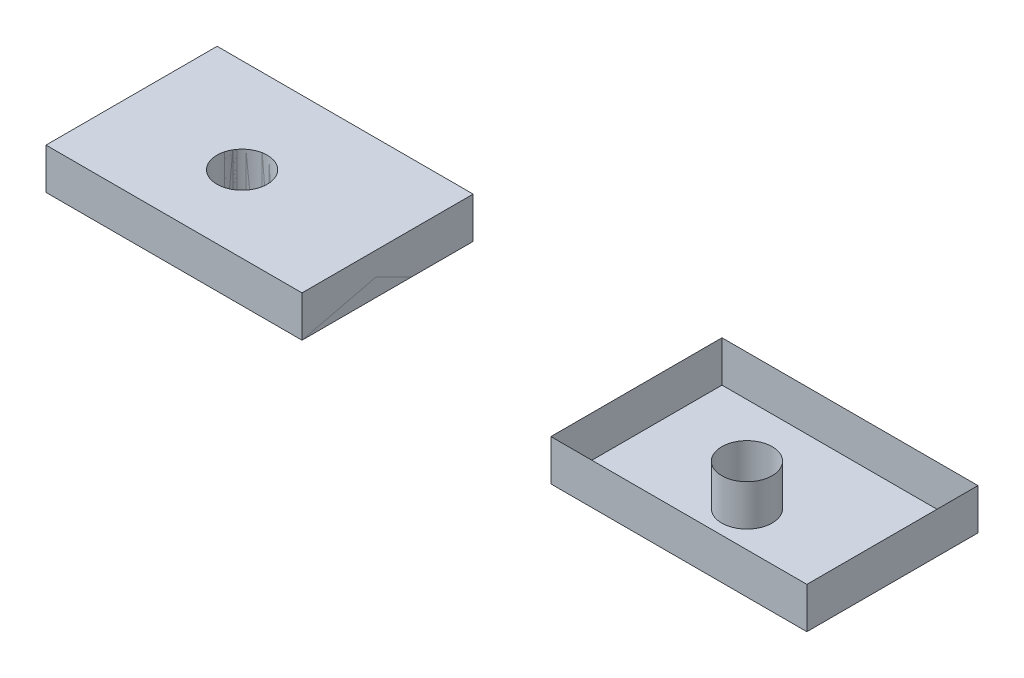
ISO-10303-21;
HEADER;
FILE_DESCRIPTION(('STEP AP214'),'2;1');
FILE_NAME('part.step','',(''),(''),'','','');
FILE_SCHEMA(('AUTOMOTIVE_DESIGN { 1 0 10303 214 1 1 1 1 }'));
ENDSEC;
DATA;
#1=APPLICATION_CONTEXT('core data for automotive mechanical design processes');
#2=APPLICATION_PROTOCOL_DEFINITION('international standard','automotive_design',2000,#1);
#3=PRODUCT_CONTEXT('',#1,'mechanical');
#4=PRODUCT('Part','Part','',(#3));
#5=PRODUCT_RELATED_PRODUCT_CATEGORY('part','',(#4));
#6=PRODUCT_DEFINITION_FORMATION('','',#4);
#7=PRODUCT_DEFINITION_CONTEXT('part definition',#1,'design');
#8=PRODUCT_DEFINITION('design','',#6,#7);
#9=PRODUCT_DEFINITION_SHAPE('','',#8);
#10=(LENGTH_UNIT() NAMED_UNIT(*) SI_UNIT(.MILLI.,.METRE.));
#11=(NAMED_UNIT(*) PLANE_ANGLE_UNIT() SI_UNIT($,.RADIAN.));
#12=(NAMED_UNIT(*) SI_UNIT($,.STERADIAN.) SOLID_ANGLE_UNIT());
#13=UNCERTAINTY_MEASURE_WITH_UNIT(LENGTH_MEASURE(1.E-05),#10,'distance_accuracy_value','');
#14=(GEOMETRIC_REPRESENTATION_CONTEXT(3) GLOBAL_UNCERTAINTY_ASSIGNED_CONTEXT((#13)) GLOBAL_UNIT_ASSIGNED_CONTEXT((#10,
#11,#12)) REPRESENTATION_CONTEXT('',''));
#15=CARTESIAN_POINT('',(0.,0.,0.));
#16=DIRECTION('',(0.,0.,1.));
#17=DIRECTION('',(1.,0.,0.));
#18=AXIS2_PLACEMENT_3D('',#15,#16,#17);
#19=CARTESIAN_POINT('',(490.265330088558,0.,-38.835495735));
#20=DIRECTION('',(0.,1.,0.));
#21=DIRECTION('',(0.,0.,1.));
#22=AXIS2_PLACEMENT_3D('',#19,#20,#21);
#23=CYLINDRICAL_SURFACE('',#22,12.7580583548);
#24=CARTESIAN_POINT('',(490.265330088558,20.7672057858,-38.835495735));
#25=DIRECTION('',(0.,1.,0.));
#26=DIRECTION('',(0.,0.,1.));
#27=AXIS2_PLACEMENT_3D('',#24,#25,#26);
#28=CIRCLE('',#27,12.7580583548);
#29=CARTESIAN_POINT('',(490.265330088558,20.7672057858,-26.0774373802));
#30=VERTEX_POINT('',#29);
#31=EDGE_CURVE('P0_E12',#30,#30,#28,.T.);
#32=ORIENTED_EDGE('',*,*,#31,.F.);
#33=EDGE_LOOP('',(#32));
#34=FACE_BOUND('',#33,.T.);
#35=CARTESIAN_POINT('',(490.265330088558,0.,-38.835495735));
#36=DIRECTION('',(0.,1.,0.));
#37=DIRECTION('',(0.,0.,1.));
#38=AXIS2_PLACEMENT_3D('',#35,#36,#37);
#39=CIRCLE('',#38,12.7580583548);
#40=CARTESIAN_POINT('',(490.265330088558,0.,-26.0774373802));
#41=VERTEX_POINT('',#40);
#42=EDGE_CURVE('P0_E43',#41,#41,#39,.F.);
#43=ORIENTED_EDGE('',*,*,#42,.F.);
#44=EDGE_LOOP('',(#43));
#45=FACE_BOUND('',#44,.T.);
#46=ADVANCED_FACE('P0_F40',(#34,#45),#23,.T.);
#47=CARTESIAN_POINT('',(429.841584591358,0.,0.));
#48=DIRECTION('',(0.,-1.,0.));
#49=DIRECTION('',(0.,0.,-1.));
#50=AXIS2_PLACEMENT_3D('',#47,#48,#49);
#51=PLANE('',#50);
#52=ORIENTED_EDGE('',*,*,#42,.T.);
#53=EDGE_LOOP('',(#52));
#54=FACE_BOUND('',#53,.T.);
#55=DIRECTION('',(0.,0.,1.));
#56=VECTOR('',#55,1.);
#57=CARTESIAN_POINT('',(559.431427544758,0.,-43.3127745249));
#58=LINE('',#57,#56);
#59=CARTESIAN_POINT('',(559.431427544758,0.,-86.6255490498));
#60=VERTEX_POINT('',#59);
#61=CARTESIAN_POINT('',(559.431427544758,0.,0.));
#62=VERTEX_POINT('',#61);
#63=EDGE_CURVE('P0_E56',#60,#62,#58,.T.);
#64=ORIENTED_EDGE('',*,*,#63,.F.);
#65=DIRECTION('',(1.,0.,0.));
#66=VECTOR('',#65,1.);
#67=CARTESIAN_POINT('',(494.636506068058,0.,-86.6255490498));
#68=LINE('',#67,#66);
#69=CARTESIAN_POINT('',(429.841584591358,0.,-86.6255490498));
#70=VERTEX_POINT('',#69);
#71=EDGE_CURVE('P0_E115',#70,#60,#68,.T.);
#72=ORIENTED_EDGE('',*,*,#71,.F.);
#73=DIRECTION('',(0.,0.,-1.));
#74=VECTOR('',#73,1.);
#75=CARTESIAN_POINT('',(429.841584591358,0.,-43.3127745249));
#76=LINE('',#75,#74);
#77=CARTESIAN_POINT('',(429.841584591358,0.,0.));
#78=VERTEX_POINT('',#77);
#79=EDGE_CURVE('P0_E86',#78,#70,#76,.T.);
#80=ORIENTED_EDGE('',*,*,#79,.F.);
#81=DIRECTION('',(-1.,0.,0.));
#82=VECTOR('',#81,1.);
#83=CARTESIAN_POINT('',(494.636506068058,0.,0.));
#84=LINE('',#83,#82);
#85=EDGE_CURVE('P0_E112',#62,#78,#84,.T.);
#86=ORIENTED_EDGE('',*,*,#85,.F.);
#87=EDGE_LOOP('',(#64,#72,#80,#86));
#88=FACE_BOUND('',#87,.T.);
#89=ADVANCED_FACE('P0_F120',(#54,#88),#51,.F.);
#90=CARTESIAN_POINT('',(559.431427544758,0.,0.));
#91=DIRECTION('',(0.,0.,-1.));
#92=DIRECTION('',(-1.,0.,0.));
#93=AXIS2_PLACEMENT_3D('',#90,#91,#92);
#94=PLANE('',#93);
#95=DIRECTION('',(0.,-1.,0.));
#96=VECTOR('',#95,1.);
#97=CARTESIAN_POINT('',(559.431427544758,10.3836028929,0.));
#98=LINE('',#97,#96);
#99=CARTESIAN_POINT('',(559.431427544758,20.7672057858,0.));
#100=VERTEX_POINT('',#99);
#101=EDGE_CURVE('P0_E73',#100,#62,#98,.T.);
#102=ORIENTED_EDGE('',*,*,#101,.T.);
#103=ORIENTED_EDGE('',*,*,#85,.T.);
#104=DIRECTION('',(0.,1.,0.));
#105=VECTOR('',#104,1.);
#106=CARTESIAN_POINT('',(429.841584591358,10.3836028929,0.));
#107=LINE('',#106,#105);
#108=CARTESIAN_POINT('',(429.841584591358,20.7672057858,0.));
#109=VERTEX_POINT('',#108);
#110=EDGE_CURVE('P0_E70',#78,#109,#107,.T.);
#111=ORIENTED_EDGE('',*,*,#110,.T.);
#112=DIRECTION('',(1.,0.,0.));
#113=VECTOR('',#112,1.);
#114=CARTESIAN_POINT('',(494.636506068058,20.7672057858,0.));
#115=LINE('',#114,#113);
#116=EDGE_CURVE('P0_E107',#109,#100,#115,.T.);
#117=ORIENTED_EDGE('',*,*,#116,.T.);
#118=EDGE_LOOP('',(#102,#103,#111,#117));
#119=FACE_BOUND('',#118,.T.);
#120=ADVANCED_FACE('P0_F122',(#119),#94,.T.);
#121=CARTESIAN_POINT('',(559.431427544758,0.,-86.6255490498));
#122=DIRECTION('',(-1.,0.,0.));
#123=DIRECTION('',(0.,0.,1.));
#124=AXIS2_PLACEMENT_3D('',#121,#122,#123);
#125=PLANE('',#124);
#126=DIRECTION('',(0.,-1.,0.));
#127=VECTOR('',#126,1.);
#128=CARTESIAN_POINT('',(559.431427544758,10.3836028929,-86.6255490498));
#129=LINE('',#128,#127);
#130=CARTESIAN_POINT('',(559.431427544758,20.7672057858,-86.6255490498));
#131=VERTEX_POINT('',#130);
#132=EDGE_CURVE('P0_E97',#131,#60,#129,.T.);
#133=ORIENTED_EDGE('',*,*,#132,.T.);
#134=ORIENTED_EDGE('',*,*,#63,.T.);
#135=ORIENTED_EDGE('',*,*,#101,.F.);
#136=DIRECTION('',(0.,0.,-1.));
#137=VECTOR('',#136,1.);
#138=CARTESIAN_POINT('',(559.431427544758,20.7672057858,-43.3127745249));
#139=LINE('',#138,#137);
#140=EDGE_CURVE('P0_E90',#100,#131,#139,.T.);
#141=ORIENTED_EDGE('',*,*,#140,.T.);
#142=EDGE_LOOP('',(#133,#134,#135,#141));
#143=FACE_BOUND('',#142,.T.);
#144=ADVANCED_FACE('P0_F118',(#143),#125,.T.);
#145=CARTESIAN_POINT('',(429.841584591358,0.,-86.6255490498));
#146=DIRECTION('',(0.,0.,1.));
#147=DIRECTION('',(1.,0.,0.));
#148=AXIS2_PLACEMENT_3D('',#145,#146,#147);
#149=PLANE('',#148);
#150=DIRECTION('',(0.,-1.,0.));
#151=VECTOR('',#150,1.);
#152=CARTESIAN_POINT('',(429.841584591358,10.3836028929,-86.6255490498));
#153=LINE('',#152,#151);
#154=CARTESIAN_POINT('',(429.841584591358,20.7672057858,-86.6255490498));
#155=VERTEX_POINT('',#154);
#156=EDGE_CURVE('P0_E82',#155,#70,#153,.T.);
#157=ORIENTED_EDGE('',*,*,#156,.T.);
#158=ORIENTED_EDGE('',*,*,#71,.T.);
#159=ORIENTED_EDGE('',*,*,#132,.F.);
#160=DIRECTION('',(-1.,0.,0.));
#161=VECTOR('',#160,1.);
#162=CARTESIAN_POINT('',(494.636506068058,20.7672057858,-86.6255490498));
#163=LINE('',#162,#161);
#164=EDGE_CURVE('P0_E91',#131,#155,#163,.T.);
#165=ORIENTED_EDGE('',*,*,#164,.T.);
#166=EDGE_LOOP('',(#157,#158,#159,#165));
#167=FACE_BOUND('',#166,.T.);
#168=ADVANCED_FACE('P0_F96',(#167),#149,.T.);
#169=CARTESIAN_POINT('',(429.841584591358,0.,0.));
#170=DIRECTION('',(1.,0.,0.));
#171=DIRECTION('',(0.,0.,-1.));
#172=AXIS2_PLACEMENT_3D('',#169,#170,#171);
#173=PLANE('',#172);
#174=ORIENTED_EDGE('',*,*,#110,.F.);
#175=ORIENTED_EDGE('',*,*,#79,.T.);
#176=ORIENTED_EDGE('',*,*,#156,.F.);
#177=DIRECTION('',(0.,0.,1.));
#178=VECTOR('',#177,1.);
#179=CARTESIAN_POINT('',(429.841584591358,20.7672057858,-43.3127745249));
#180=LINE('',#179,#178);
#181=EDGE_CURVE('P0_E84',#155,#109,#180,.T.);
#182=ORIENTED_EDGE('',*,*,#181,.T.);
#183=EDGE_LOOP('',(#174,#175,#176,#182));
#184=FACE_BOUND('',#183,.T.);
#185=ADVANCED_FACE('P0_F41',(#184),#173,.T.);
#186=OPEN_SHELL('',(#46,#89,#120,#144,#168,#185));
#187=SHELL_BASED_SURFACE_MODEL('P0_B2',(#186));
#188=CARTESIAN_POINT('',(174.275363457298,20.7672057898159,0.));
#189=DIRECTION('',(1.,0.,0.));
#190=DIRECTION('',(0.,0.,-1.));
#191=AXIS2_PLACEMENT_3D('',#188,#189,#190);
#192=PLANE('',#191);
#193=DIRECTION('',(0.,0.,1.));
#194=VECTOR('',#193,1.);
#195=CARTESIAN_POINT('',(174.275363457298,0.,0.));
#196=LINE('',#195,#194);
#197=CARTESIAN_POINT('',(174.275363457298,0.,-86.6255490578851));
#198=VERTEX_POINT('',#197);
#199=CARTESIAN_POINT('',(174.275363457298,0.,0.));
#200=VERTEX_POINT('',#199);
#201=EDGE_CURVE('P0_E230',#198,#200,#196,.T.);
#202=ORIENTED_EDGE('',*,*,#201,.T.);
#203=DIRECTION('',(0.,-1.,0.));
#204=VECTOR('',#203,1.);
#205=CARTESIAN_POINT('',(174.275363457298,20.7672057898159,0.));
#206=LINE('',#205,#204);
#207=CARTESIAN_POINT('',(174.275363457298,20.7672057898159,0.));
#208=VERTEX_POINT('',#207);
#209=EDGE_CURVE('P0_E38',#208,#200,#206,.T.);
#210=ORIENTED_EDGE('',*,*,#209,.F.);
#211=DIRECTION('',(0.,0.,1.));
#212=VECTOR('',#211,1.);
#213=CARTESIAN_POINT('',(174.275363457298,20.7672057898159,0.));
#214=LINE('',#213,#212);
#215=CARTESIAN_POINT('',(174.275363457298,20.7672057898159,-86.6255490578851));
#216=VERTEX_POINT('',#215);
#217=EDGE_CURVE('P0_E253',#216,#208,#214,.T.);
#218=ORIENTED_EDGE('',*,*,#217,.F.);
#219=DIRECTION('',(0.,-1.,0.));
#220=VECTOR('',#219,1.);
#221=CARTESIAN_POINT('',(174.275363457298,20.7672057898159,-86.6255490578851));
#222=LINE('',#221,#220);
#223=EDGE_CURVE('P0_E242',#216,#198,#222,.T.);
#224=ORIENTED_EDGE('',*,*,#223,.T.);
#225=EDGE_LOOP('',(#202,#210,#218,#224));
#226=FACE_BOUND('',#225,.T.);
#227=ADVANCED_FACE('P0_F186',(#226),#192,.F.);
#228=CARTESIAN_POINT('',(174.275363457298,20.7672057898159,0.));
#229=DIRECTION('',(0.,0.,-1.));
#230=DIRECTION('',(-1.,0.,0.));
#231=AXIS2_PLACEMENT_3D('',#228,#229,#230);
#232=PLANE('',#231);
#233=DIRECTION('',(1.,0.,0.));
#234=VECTOR('',#233,1.);
#235=CARTESIAN_POINT('',(174.275363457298,0.,0.));
#236=LINE('',#235,#234);
#237=CARTESIAN_POINT('',(303.86520640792,0.,0.));
#238=VERTEX_POINT('',#237);
#239=EDGE_CURVE('P0_E226',#200,#238,#236,.T.);
#240=ORIENTED_EDGE('',*,*,#239,.T.);
#241=DIRECTION('',(0.,-1.,0.));
#242=VECTOR('',#241,1.);
#243=CARTESIAN_POINT('',(303.86520640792,20.7672057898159,0.));
#244=LINE('',#243,#242);
#245=CARTESIAN_POINT('',(303.86520640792,20.7672057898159,0.));
#246=VERTEX_POINT('',#245);
#247=EDGE_CURVE('P0_E193',#246,#238,#244,.T.);
#248=ORIENTED_EDGE('',*,*,#247,.F.);
#249=DIRECTION('',(1.,0.,0.));
#250=VECTOR('',#249,1.);
#251=CARTESIAN_POINT('',(174.275363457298,20.7672057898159,0.));
#252=LINE('',#251,#250);
#253=EDGE_CURVE('P0_E238',#208,#246,#252,.T.);
#254=ORIENTED_EDGE('',*,*,#253,.F.);
#255=ORIENTED_EDGE('',*,*,#209,.T.);
#256=EDGE_LOOP('',(#240,#248,#254,#255));
#257=FACE_BOUND('',#256,.T.);
#258=ADVANCED_FACE('P0_F237',(#257),#232,.F.);
#259=CARTESIAN_POINT('',(303.86520640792,20.7672057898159,0.));
#260=DIRECTION('',(-1.,0.,0.));
#261=DIRECTION('',(0.,0.,1.));
#262=AXIS2_PLACEMENT_3D('',#259,#260,#261);
#263=PLANE('',#262);
#264=DIRECTION('',(0.,0.,-1.));
#265=VECTOR('',#264,1.);
#266=CARTESIAN_POINT('',(303.86520640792,0.,0.));
#267=LINE('',#266,#265);
#268=CARTESIAN_POINT('',(303.86520640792,0.,-86.6255490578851));
#269=VERTEX_POINT('',#268);
#270=EDGE_CURVE('P0_E231',#238,#269,#267,.T.);
#271=ORIENTED_EDGE('',*,*,#270,.T.);
#272=DIRECTION('',(0.,-1.,0.));
#273=VECTOR('',#272,1.);
#274=CARTESIAN_POINT('',(303.86520640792,20.7672057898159,-86.6255490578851));
#275=LINE('',#274,#273);
#276=CARTESIAN_POINT('',(303.86520640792,20.7672057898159,-86.6255490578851));
#277=VERTEX_POINT('',#276);
#278=EDGE_CURVE('P0_E259',#277,#269,#275,.T.);
#279=ORIENTED_EDGE('',*,*,#278,.F.);
#280=DIRECTION('',(0.,0.,-1.));
#281=VECTOR('',#280,1.);
#282=CARTESIAN_POINT('',(303.86520640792,20.7672057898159,0.));
#283=LINE('',#282,#281);
#284=EDGE_CURVE('P0_E205',#246,#277,#283,.T.);
#285=ORIENTED_EDGE('',*,*,#284,.F.);
#286=ORIENTED_EDGE('',*,*,#247,.T.);
#287=EDGE_LOOP('',(#271,#279,#285,#286));
#288=FACE_BOUND('',#287,.T.);
#289=ADVANCED_FACE('P0_F262',(#288),#263,.F.);
#290=CARTESIAN_POINT('',(174.275363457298,20.7672057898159,-86.6255490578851));
#291=DIRECTION('',(0.,0.,1.));
#292=DIRECTION('',(1.,0.,0.));
#293=AXIS2_PLACEMENT_3D('',#290,#291,#292);
#294=PLANE('',#293);
#295=DIRECTION('',(-1.,0.,0.));
#296=VECTOR('',#295,1.);
#297=CARTESIAN_POINT('',(174.275363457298,0.,-86.6255490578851));
#298=LINE('',#297,#296);
#299=EDGE_CURVE('P0_E251',#269,#198,#298,.T.);
#300=ORIENTED_EDGE('',*,*,#299,.T.);
#301=ORIENTED_EDGE('',*,*,#223,.F.);
#302=DIRECTION('',(-1.,0.,0.));
#303=VECTOR('',#302,1.);
#304=CARTESIAN_POINT('',(174.275363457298,20.7672057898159,-86.6255490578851));
#305=LINE('',#304,#303);
#306=EDGE_CURVE('P0_E200',#277,#216,#305,.T.);
#307=ORIENTED_EDGE('',*,*,#306,.F.);
#308=ORIENTED_EDGE('',*,*,#278,.T.);
#309=EDGE_LOOP('',(#300,#301,#307,#308));
#310=FACE_BOUND('',#309,.T.);
#311=ADVANCED_FACE('P0_F264',(#310),#294,.F.);
#312=CARTESIAN_POINT('',(174.275363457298,20.7672057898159,-86.6255490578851));
#313=DIRECTION('',(0.,-1.,0.));
#314=DIRECTION('',(0.,0.,-1.));
#315=AXIS2_PLACEMENT_3D('',#312,#313,#314);
#316=PLANE('',#315);
#317=CARTESIAN_POINT('',(234.699108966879,20.7672057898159,-38.8354957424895));
#318=DIRECTION('',(0.,1.,0.));
#319=DIRECTION('',(0.,0.,1.));
#320=AXIS2_PLACEMENT_3D('',#317,#318,#319);
#321=CIRCLE('',#320,12.7580583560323);
#322=CARTESIAN_POINT('',(234.699108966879,20.7672057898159,-26.0774373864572));
#323=VERTEX_POINT('',#322);
#324=EDGE_CURVE('P0_E246',#323,#323,#321,.T.);
#325=ORIENTED_EDGE('',*,*,#324,.F.);
#326=EDGE_LOOP('',(#325));
#327=FACE_BOUND('',#326,.T.);
#328=ORIENTED_EDGE('',*,*,#217,.T.);
#329=ORIENTED_EDGE('',*,*,#253,.T.);
#330=ORIENTED_EDGE('',*,*,#284,.T.);
#331=ORIENTED_EDGE('',*,*,#306,.T.);
#332=EDGE_LOOP('',(#328,#329,#330,#331));
#333=FACE_BOUND('',#332,.T.);
#334=ADVANCED_FACE('P0_F265',(#327,#333),#316,.F.);
#335=CARTESIAN_POINT('',(174.275363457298,0.,-86.6255490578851));
#336=DIRECTION('',(0.,-1.,0.));
#337=DIRECTION('',(0.,0.,-1.));
#338=AXIS2_PLACEMENT_3D('',#335,#336,#337);
#339=PLANE('',#338);
#340=CARTESIAN_POINT('',(234.699108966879,0.,-38.8354957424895));
#341=DIRECTION('',(0.,1.,0.));
#342=DIRECTION('',(0.,0.,1.));
#343=AXIS2_PLACEMENT_3D('',#340,#341,#342);
#344=CIRCLE('',#343,12.7580583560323);
#345=CARTESIAN_POINT('',(234.699108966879,0.,-26.0774373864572));
#346=VERTEX_POINT('',#345);
#347=EDGE_CURVE('P0_E243',#346,#346,#344,.T.);
#348=ORIENTED_EDGE('',*,*,#347,.T.);
#349=EDGE_LOOP('',(#348));
#350=FACE_BOUND('',#349,.T.);
#351=ORIENTED_EDGE('',*,*,#201,.F.);
#352=ORIENTED_EDGE('',*,*,#299,.F.);
#353=ORIENTED_EDGE('',*,*,#270,.F.);
#354=ORIENTED_EDGE('',*,*,#239,.F.);
#355=EDGE_LOOP('',(#351,#352,#353,#354));
#356=FACE_BOUND('',#355,.T.);
#357=ADVANCED_FACE('P0_F227',(#350,#356),#339,.T.);
#358=CARTESIAN_POINT('',(234.699108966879,0.,-38.8354957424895));
#359=DIRECTION('',(0.,1.,0.));
#360=DIRECTION('',(0.,0.,1.));
#361=AXIS2_PLACEMENT_3D('',#358,#359,#360);
#362=CYLINDRICAL_SURFACE('',#361,12.7580583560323);
#363=CARTESIAN_POINT('',(234.699108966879,0.,-26.0774373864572));
#364=CARTESIAN_POINT('',(234.699108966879,0.216325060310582,-26.0774373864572));
#365=CARTESIAN_POINT('',(234.699108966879,0.432650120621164,-26.0774373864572));
#366=CARTESIAN_POINT('',(234.699108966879,0.865300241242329,-26.0774373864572));
#367=CARTESIAN_POINT('',(234.699108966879,1.08162530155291,-26.0774373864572));
#368=CARTESIAN_POINT('',(234.699108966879,1.51427542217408,-26.0774373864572));
#369=CARTESIAN_POINT('',(234.699108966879,1.73060048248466,-26.0774373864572));
#370=CARTESIAN_POINT('',(234.699108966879,2.16325060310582,-26.0774373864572));
#371=CARTESIAN_POINT('',(234.699108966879,2.3795756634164,-26.0774373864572));
#372=CARTESIAN_POINT('',(234.699108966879,2.81222578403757,-26.0774373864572));
#373=CARTESIAN_POINT('',(234.699108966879,3.02855084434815,-26.0774373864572));
#374=CARTESIAN_POINT('',(234.699108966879,3.46120096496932,-26.0774373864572));
#375=CARTESIAN_POINT('',(234.699108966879,3.6775260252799,-26.0774373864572));
#376=CARTESIAN_POINT('',(234.699108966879,4.11017614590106,-26.0774373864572));
#377=CARTESIAN_POINT('',(234.699108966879,4.32650120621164,-26.0774373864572));
#378=CARTESIAN_POINT('',(234.699108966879,4.75915132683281,-26.0774373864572));
#379=CARTESIAN_POINT('',(234.699108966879,4.97547638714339,-26.0774373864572));
#380=CARTESIAN_POINT('',(234.699108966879,5.40812650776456,-26.0774373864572));
#381=CARTESIAN_POINT('',(234.699108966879,5.62445156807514,-26.0774373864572));
#382=CARTESIAN_POINT('',(234.699108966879,6.0571016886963,-26.0774373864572));
#383=CARTESIAN_POINT('',(234.699108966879,6.27342674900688,-26.0774373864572));
#384=CARTESIAN_POINT('',(234.699108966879,6.70607686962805,-26.0774373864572));
#385=CARTESIAN_POINT('',(234.699108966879,6.92240192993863,-26.0774373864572));
#386=CARTESIAN_POINT('',(234.699108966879,7.3550520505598,-26.0774373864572));
#387=CARTESIAN_POINT('',(234.699108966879,7.57137711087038,-26.0774373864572));
#388=CARTESIAN_POINT('',(234.699108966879,8.00402723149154,-26.0774373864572));
#389=CARTESIAN_POINT('',(234.699108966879,8.22035229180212,-26.0774373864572));
#390=CARTESIAN_POINT('',(234.699108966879,8.65300241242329,-26.0774373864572));
#391=CARTESIAN_POINT('',(234.699108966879,8.86932747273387,-26.0774373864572));
#392=CARTESIAN_POINT('',(234.699108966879,9.30197759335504,-26.0774373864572));
#393=CARTESIAN_POINT('',(234.699108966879,9.51830265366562,-26.0774373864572));
#394=CARTESIAN_POINT('',(234.699108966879,9.95095277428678,-26.0774373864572));
#395=CARTESIAN_POINT('',(234.699108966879,10.1672778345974,-26.0774373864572));
#396=CARTESIAN_POINT('',(234.699108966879,10.5999279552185,-26.0774373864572));
#397=CARTESIAN_POINT('',(234.699108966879,10.8162530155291,-26.0774373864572));
#398=CARTESIAN_POINT('',(234.699108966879,11.2489031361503,-26.0774373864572));
#399=CARTESIAN_POINT('',(234.699108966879,11.4652281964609,-26.0774373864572));
#400=CARTESIAN_POINT('',(234.699108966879,11.897878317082,-26.0774373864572));
#401=CARTESIAN_POINT('',(234.699108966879,12.1142033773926,-26.0774373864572));
#402=CARTESIAN_POINT('',(234.699108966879,12.5468534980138,-26.0774373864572));
#403=CARTESIAN_POINT('',(234.699108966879,12.7631785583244,-26.0774373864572));
#404=CARTESIAN_POINT('',(234.699108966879,13.1958286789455,-26.0774373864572));
#405=CARTESIAN_POINT('',(234.699108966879,13.4121537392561,-26.0774373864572));
#406=CARTESIAN_POINT('',(234.699108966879,13.8448038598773,-26.0774373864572));
#407=CARTESIAN_POINT('',(234.699108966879,14.0611289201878,-26.0774373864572));
#408=CARTESIAN_POINT('',(234.699108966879,14.493779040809,-26.0774373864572));
#409=CARTESIAN_POINT('',(234.699108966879,14.7101041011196,-26.0774373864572));
#410=CARTESIAN_POINT('',(234.699108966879,15.1427542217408,-26.0774373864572));
#411=CARTESIAN_POINT('',(234.699108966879,15.3590792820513,-26.0774373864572));
#412=CARTESIAN_POINT('',(234.699108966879,15.7917294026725,-26.0774373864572));
#413=CARTESIAN_POINT('',(234.699108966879,16.0080544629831,-26.0774373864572));
#414=CARTESIAN_POINT('',(234.699108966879,16.4407045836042,-26.0774373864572));
#415=CARTESIAN_POINT('',(234.699108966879,16.6570296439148,-26.0774373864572));
#416=CARTESIAN_POINT('',(234.699108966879,17.089679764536,-26.0774373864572));
#417=CARTESIAN_POINT('',(234.699108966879,17.3060048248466,-26.0774373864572));
#418=CARTESIAN_POINT('',(234.699108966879,17.7386549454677,-26.0774373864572));
#419=CARTESIAN_POINT('',(234.699108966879,17.9549800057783,-26.0774373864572));
#420=CARTESIAN_POINT('',(234.699108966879,18.3876301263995,-26.0774373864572));
#421=CARTESIAN_POINT('',(234.699108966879,18.6039551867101,-26.0774373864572));
#422=CARTESIAN_POINT('',(234.699108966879,19.0366053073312,-26.0774373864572));
#423=CARTESIAN_POINT('',(234.699108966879,19.2529303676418,-26.0774373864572));
#424=CARTESIAN_POINT('',(234.699108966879,19.685580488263,-26.0774373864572));
#425=CARTESIAN_POINT('',(234.699108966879,19.9019055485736,-26.0774373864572));
#426=CARTESIAN_POINT('',(234.699108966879,20.3345556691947,-26.0774373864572));
#427=CARTESIAN_POINT('',(234.699108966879,20.5508807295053,-26.0774373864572));
#428=CARTESIAN_POINT('',(234.699108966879,20.7672057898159,-26.0774373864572));
#429=B_SPLINE_CURVE_WITH_KNOTS('',3,(#363,#364,#365,#366,#367,#368,#369,#370,#371,#372,#373,
#374,#375,#376,#377,#378,#379,#380,#381,#382,#383,#384,#385,#386,#387,#388,#389,#390,#391,#392,
#393,#394,#395,#396,#397,#398,#399,#400,#401,#402,#403,#404,#405,#406,#407,#408,#409,#410,#411,
#412,#413,#414,#415,#416,#417,#418,#419,#420,#421,#422,#423,#424,#425,#426,#427,#428),
.UNSPECIFIED.,.F.,.F.,(4,2,2,2,2,2,2,2,2,2,2,2,2,2,2,2,2,2,2,2,2,2,2,2,2,2,2,2,2,2,2,2,4),(0.,
0.648975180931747,1.29795036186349,1.94692554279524,2.59590072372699,3.24487590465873,
3.89385108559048,4.54282626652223,5.19180144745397,5.84077662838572,6.48975180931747,
7.13872699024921,7.78770217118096,8.43667735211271,9.08565253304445,9.7346277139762,
10.3836028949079,11.0325780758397,11.6815532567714,12.3305284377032,12.9795036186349,
13.6284787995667,14.2774539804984,14.9264291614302,15.5754043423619,16.2243795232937,
16.8733547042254,17.5223298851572,18.1713050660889,18.8202802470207,19.4692554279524,
20.1182306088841,20.7672057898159),.UNSPECIFIED.);
#430=EDGE_CURVE('P0_BSEAM273',#346,#323,#429,.T.);
#431=ORIENTED_EDGE('',*,*,#347,.F.);
#432=ORIENTED_EDGE('',*,*,#324,.T.);
#433=ORIENTED_EDGE('',*,*,#430,.T.);
#434=ORIENTED_EDGE('',*,*,#430,.F.);
#435=EDGE_LOOP('',(#431,#433,#432,#434));
#436=FACE_BOUND('',#435,.T.);
#437=ADVANCED_FACE('P0_F273',(#436),#362,.F.);
#438=CLOSED_SHELL('',(#227,#258,#289,#311,#334,#357,#437));
#439=MANIFOLD_SOLID_BREP('P0_B6',#438);
#440=CARTESIAN_POINT('',(234.69910896,0.,-38.835495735));
#441=DIRECTION('',(0.,1.,0.));
#442=DIRECTION('',(0.,0.,1.));
#443=AXIS2_PLACEMENT_3D('',#440,#441,#442);
#444=CYLINDRICAL_SURFACE('',#443,12.7580583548);
#445=CARTESIAN_POINT('',(234.69910896,20.7672057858,-38.835495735));
#446=DIRECTION('',(0.,1.,0.));
#447=DIRECTION('',(0.,0.,1.));
#448=AXIS2_PLACEMENT_3D('',#445,#446,#447);
#449=CIRCLE('',#448,12.7580583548);
#450=CARTESIAN_POINT('',(234.69910896,20.7672057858,-26.0774373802));
#451=VERTEX_POINT('',#450);
#452=EDGE_CURVE('P1_E11',#451,#451,#449,.T.);
#453=ORIENTED_EDGE('',*,*,#452,.F.);
#454=EDGE_LOOP('',(#453));
#455=FACE_BOUND('',#454,.T.);
#456=CARTESIAN_POINT('',(234.69910896,0.,-38.835495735));
#457=DIRECTION('',(0.,1.,0.));
#458=DIRECTION('',(0.,0.,1.));
#459=AXIS2_PLACEMENT_3D('',#456,#457,#458);
#460=CIRCLE('',#459,12.7580583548);
#461=CARTESIAN_POINT('',(234.69910896,0.,-26.0774373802));
#462=VERTEX_POINT('',#461);
#463=EDGE_CURVE('P1_E19',#462,#462,#460,.F.);
#464=ORIENTED_EDGE('',*,*,#463,.F.);
#465=EDGE_LOOP('',(#464));
#466=FACE_BOUND('',#465,.T.);
#467=ADVANCED_FACE('P1_F16',(#455,#466),#444,.T.);
#468=CARTESIAN_POINT('',(174.2753634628,0.,0.));
#469=DIRECTION('',(0.,-1.,0.));
#470=DIRECTION('',(0.,0.,-1.));
#471=AXIS2_PLACEMENT_3D('',#468,#469,#470);
#472=PLANE('',#471);
#473=ORIENTED_EDGE('',*,*,#463,.T.);
#474=EDGE_LOOP('',(#473));
#475=FACE_BOUND('',#474,.T.);
#476=DIRECTION('',(0.,0.,1.));
#477=VECTOR('',#476,1.);
#478=CARTESIAN_POINT('',(303.8652064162,0.,-43.3127745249));
#479=LINE('',#478,#477);
#480=CARTESIAN_POINT('',(303.8652064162,0.,-86.6255490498));
#481=VERTEX_POINT('',#480);
#482=CARTESIAN_POINT('',(303.8652064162,0.,0.));
#483=VERTEX_POINT('',#482);
#484=EDGE_CURVE('P1_E32',#481,#483,#479,.T.);
#485=ORIENTED_EDGE('',*,*,#484,.F.);
#486=DIRECTION('',(1.,0.,0.));
#487=VECTOR('',#486,1.);
#488=CARTESIAN_POINT('',(239.0702849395,0.,-86.6255490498));
#489=LINE('',#488,#487);
#490=CARTESIAN_POINT('',(174.2753634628,0.,-86.6255490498));
#491=VERTEX_POINT('',#490);
#492=EDGE_CURVE('P1_E92',#491,#481,#489,.T.);
#493=ORIENTED_EDGE('',*,*,#492,.F.);
#494=DIRECTION('',(0.,0.,-1.));
#495=VECTOR('',#494,1.);
#496=CARTESIAN_POINT('',(174.2753634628,0.,-43.3127745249));
#497=LINE('',#496,#495);
#498=CARTESIAN_POINT('',(174.2753634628,0.,0.));
#499=VERTEX_POINT('',#498);
#500=EDGE_CURVE('P1_E62',#499,#491,#497,.T.);
#501=ORIENTED_EDGE('',*,*,#500,.F.);
#502=DIRECTION('',(-1.,0.,0.));
#503=VECTOR('',#502,1.);
#504=CARTESIAN_POINT('',(239.0702849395,0.,0.));
#505=LINE('',#504,#503);
#506=EDGE_CURVE('P1_E89',#483,#499,#505,.T.);
#507=ORIENTED_EDGE('',*,*,#506,.F.);
#508=EDGE_LOOP('',(#485,#493,#501,#507));
#509=FACE_BOUND('',#508,.T.);
#510=ADVANCED_FACE('P1_F97',(#475,#509),#472,.F.);
#511=CARTESIAN_POINT('',(303.8652064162,0.,0.));
#512=DIRECTION('',(0.,0.,-1.));
#513=DIRECTION('',(-1.,0.,0.));
#514=AXIS2_PLACEMENT_3D('',#511,#512,#513);
#515=PLANE('',#514);
#516=DIRECTION('',(0.,-1.,0.));
#517=VECTOR('',#516,1.);
#518=CARTESIAN_POINT('',(303.8652064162,10.3836028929,0.));
#519=LINE('',#518,#517);
#520=CARTESIAN_POINT('',(303.8652064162,20.7672057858,0.));
#521=VERTEX_POINT('',#520);
#522=EDGE_CURVE('P1_E49',#521,#483,#519,.T.);
#523=ORIENTED_EDGE('',*,*,#522,.T.);
#524=ORIENTED_EDGE('',*,*,#506,.T.);
#525=DIRECTION('',(0.,1.,0.));
#526=VECTOR('',#525,1.);
#527=CARTESIAN_POINT('',(174.2753634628,10.3836028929,0.));
#528=LINE('',#527,#526);
#529=CARTESIAN_POINT('',(174.2753634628,20.7672057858,0.));
#530=VERTEX_POINT('',#529);
#531=EDGE_CURVE('P1_E46',#499,#530,#528,.T.);
#532=ORIENTED_EDGE('',*,*,#531,.T.);
#533=DIRECTION('',(1.,0.,0.));
#534=VECTOR('',#533,1.);
#535=CARTESIAN_POINT('',(239.0702849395,20.7672057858,0.));
#536=LINE('',#535,#534);
#537=EDGE_CURVE('P1_E84',#530,#521,#536,.T.);
#538=ORIENTED_EDGE('',*,*,#537,.T.);
#539=EDGE_LOOP('',(#523,#524,#532,#538));
#540=FACE_BOUND('',#539,.T.);
#541=ADVANCED_FACE('P1_F99',(#540),#515,.T.);
#542=CARTESIAN_POINT('',(303.8652064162,0.,-86.6255490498));
#543=DIRECTION('',(-1.,0.,0.));
#544=DIRECTION('',(0.,0.,1.));
#545=AXIS2_PLACEMENT_3D('',#542,#543,#544);
#546=PLANE('',#545);
#547=DIRECTION('',(0.,-1.,0.));
#548=VECTOR('',#547,1.);
#549=CARTESIAN_POINT('',(303.8652064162,10.3836028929,-86.6255490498));
#550=LINE('',#549,#548);
#551=CARTESIAN_POINT('',(303.8652064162,20.7672057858,-86.6255490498));
#552=VERTEX_POINT('',#551);
#553=EDGE_CURVE('P1_E73',#552,#481,#550,.T.);
#554=ORIENTED_EDGE('',*,*,#553,.T.);
#555=ORIENTED_EDGE('',*,*,#484,.T.);
#556=ORIENTED_EDGE('',*,*,#522,.F.);
#557=DIRECTION('',(0.,0.,-1.));
#558=VECTOR('',#557,1.);
#559=CARTESIAN_POINT('',(303.8652064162,20.7672057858,-43.3127745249));
#560=LINE('',#559,#558);
#561=EDGE_CURVE('P1_E66',#521,#552,#560,.T.);
#562=ORIENTED_EDGE('',*,*,#561,.T.);
#563=EDGE_LOOP('',(#554,#555,#556,#562));
#564=FACE_BOUND('',#563,.T.);
#565=ADVANCED_FACE('P1_F95',(#564),#546,.T.);
#566=CARTESIAN_POINT('',(174.2753634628,0.,-86.6255490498));
#567=DIRECTION('',(0.,0.,1.));
#568=DIRECTION('',(1.,0.,0.));
#569=AXIS2_PLACEMENT_3D('',#566,#567,#568);
#570=PLANE('',#569);
#571=DIRECTION('',(0.,-1.,0.));
#572=VECTOR('',#571,1.);
#573=CARTESIAN_POINT('',(174.2753634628,10.3836028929,-86.6255490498));
#574=LINE('',#573,#572);
#575=CARTESIAN_POINT('',(174.2753634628,20.7672057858,-86.6255490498));
#576=VERTEX_POINT('',#575);
#577=EDGE_CURVE('P1_E58',#576,#491,#574,.T.);
#578=ORIENTED_EDGE('',*,*,#577,.T.);
#579=ORIENTED_EDGE('',*,*,#492,.T.);
#580=ORIENTED_EDGE('',*,*,#553,.F.);
#581=DIRECTION('',(-1.,0.,0.));
#582=VECTOR('',#581,1.);
#583=CARTESIAN_POINT('',(239.0702849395,20.7672057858,-86.6255490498));
#584=LINE('',#583,#582);
#585=EDGE_CURVE('P1_E67',#552,#576,#584,.T.);
#586=ORIENTED_EDGE('',*,*,#585,.T.);
#587=EDGE_LOOP('',(#578,#579,#580,#586));
#588=FACE_BOUND('',#587,.T.);
#589=ADVANCED_FACE('P1_F72',(#588),#570,.T.);
#590=CARTESIAN_POINT('',(174.2753634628,0.,0.));
#591=DIRECTION('',(1.,0.,0.));
#592=DIRECTION('',(0.,0.,-1.));
#593=AXIS2_PLACEMENT_3D('',#590,#591,#592);
#594=PLANE('',#593);
#595=ORIENTED_EDGE('',*,*,#531,.F.);
#596=ORIENTED_EDGE('',*,*,#500,.T.);
#597=ORIENTED_EDGE('',*,*,#577,.F.);
#598=DIRECTION('',(0.,0.,1.));
#599=VECTOR('',#598,1.);
#600=CARTESIAN_POINT('',(174.2753634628,20.7672057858,-43.3127745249));
#601=LINE('',#600,#599);
#602=EDGE_CURVE('P1_E60',#576,#530,#601,.T.);
#603=ORIENTED_EDGE('',*,*,#602,.T.);
#604=EDGE_LOOP('',(#595,#596,#597,#603));
#605=FACE_BOUND('',#604,.T.);
#606=ADVANCED_FACE('P1_F17',(#605),#594,.T.);
#607=OPEN_SHELL('',(#467,#510,#541,#565,#589,#606));
#608=SHELL_BASED_SURFACE_MODEL('P1_B1',(#607));
#609=ADVANCED_BREP_SHAPE_REPRESENTATION('',(#18,#439),#14);
#610=MANIFOLD_SURFACE_SHAPE_REPRESENTATION('',(#18,#187,#608),#14);
#611=SHAPE_REPRESENTATION('',(#18),#14);
#612=SHAPE_DEFINITION_REPRESENTATION(#9,#611);
#613=SHAPE_REPRESENTATION_RELATIONSHIP('','',#611,#609);
#614=SHAPE_REPRESENTATION_RELATIONSHIP('','',#611,#610);
ENDSEC;
END-ISO-10303-21;
